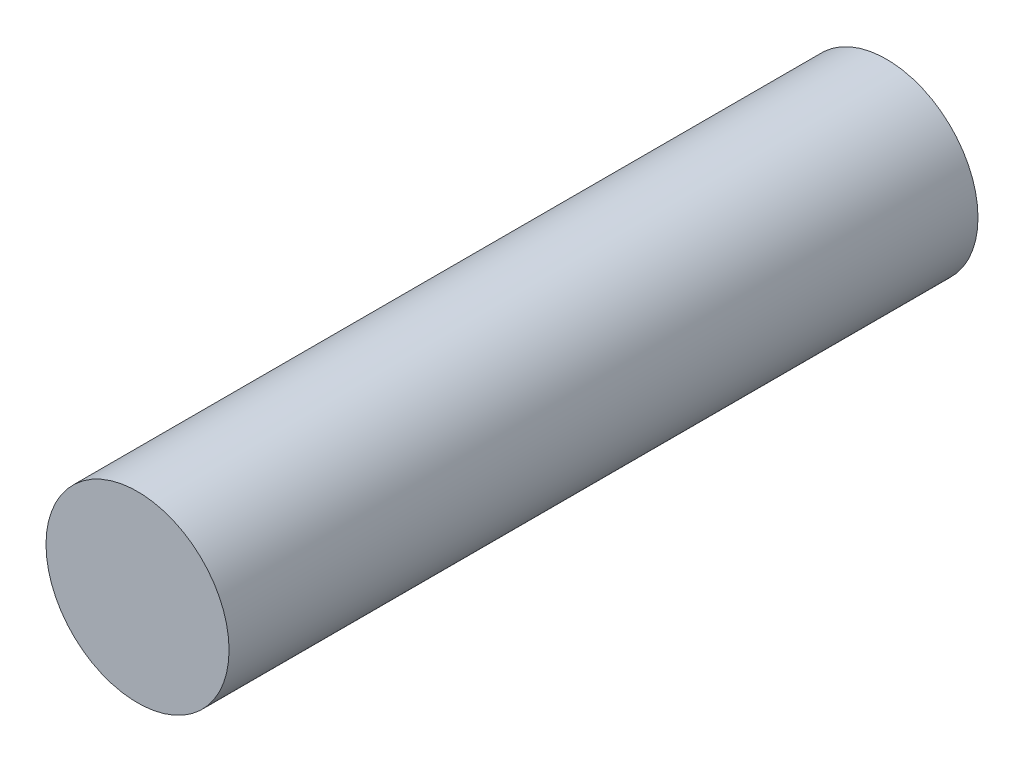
from build123d import *

# Parameters (mm, degrees)
ESQUISSE1_R          = 1.65
BASE_EXTRUSION_DEPTH = 6.75


with BuildPart() as part:
    # Esquisse1 → Base-Extrusion (new, symmetric)
    with BuildSketch(Plane(origin=(0, 0, -13.5), x_dir=(-1, 0, 0), z_dir=(0, 0, -1))):
        with Locations(Location((0, 0, 0), (0, 0, 180))):
            Circle(ESQUISSE1_R)
    extrude(amount=BASE_EXTRUSION_DEPTH, both=True)


solid = part.part
